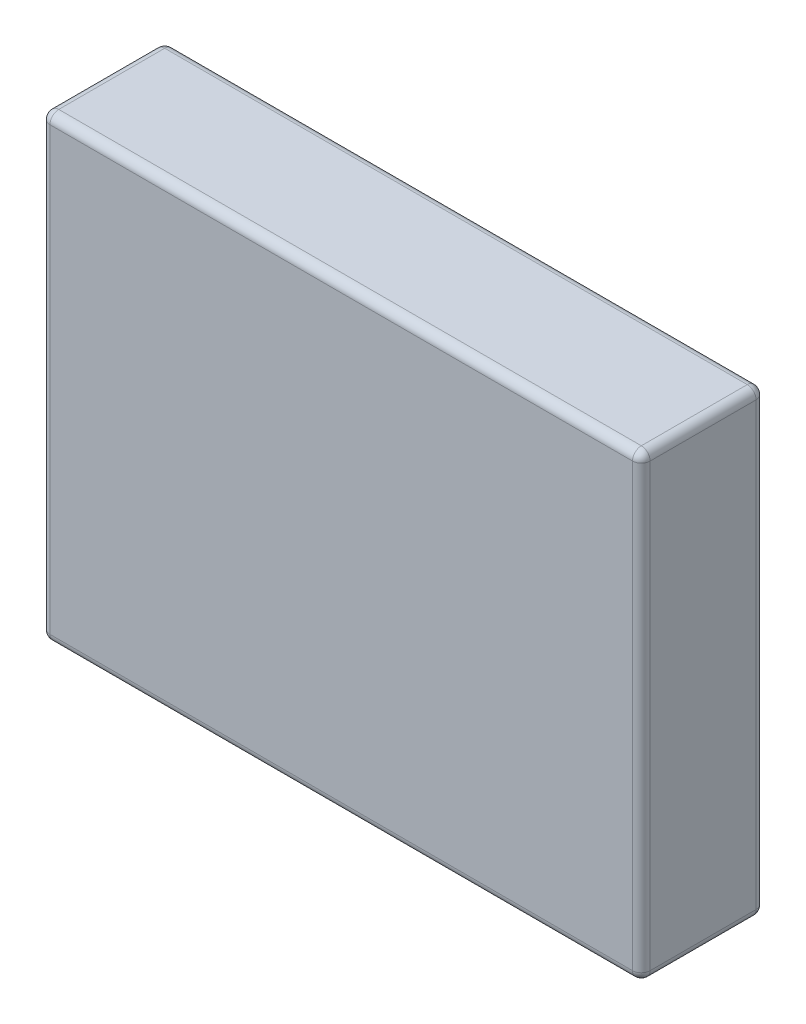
from build123d import *

# Parameters (mm, degrees)
ESQUISSE1_W          = 340
ESQUISSE1_H          = 260
BASE_EXTRUSION_DEPTH = 70
CONG_1_R             = 5


with BuildPart() as part:
    # Esquisse1 → Base-Extrusion (new body)
    with BuildSketch(Plane.XY):
        with Locations((170, -130)):
            Rectangle(ESQUISSE1_W, ESQUISSE1_H)
    extrude(amount=BASE_EXTRUSION_DEPTH)

    # Cong_1
    cong_1_edges = [part.edges().sort_by_distance(p)[0] for p in [
        (0, 0, 35),
        (340, 0, 35),
        (170, 0, 0),
        (170, 0, 70),
        (340, -260, 35),
        (340, -130, 0),
        (340, -130, 70),
        (0, -260, 35),
        (170, -260, 0),
        (170, -260, 70),
        (0, -130, 0),
        (0, -130, 70),
    ]]
    fillet(cong_1_edges, radius=CONG_1_R)


solid = part.part
